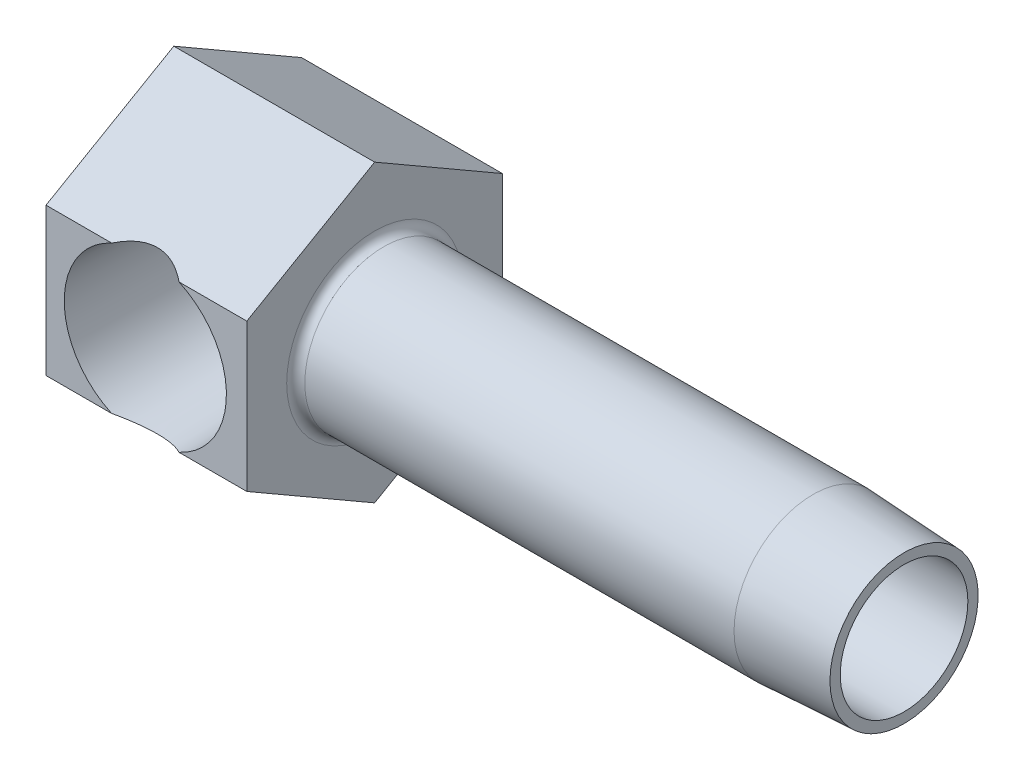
ISO-10303-21;
HEADER;
FILE_DESCRIPTION(('STEP AP214'),'2;1');
FILE_NAME('part.step','',(''),(''),'','','');
FILE_SCHEMA(('AUTOMOTIVE_DESIGN { 1 0 10303 214 1 1 1 1 }'));
ENDSEC;
DATA;
#1=APPLICATION_CONTEXT('core data for automotive mechanical design processes');
#2=APPLICATION_PROTOCOL_DEFINITION('international standard','automotive_design',2000,#1);
#3=PRODUCT_CONTEXT('',#1,'mechanical');
#4=PRODUCT('Part','Part','',(#3));
#5=PRODUCT_RELATED_PRODUCT_CATEGORY('part','',(#4));
#6=PRODUCT_DEFINITION_FORMATION('','',#4);
#7=PRODUCT_DEFINITION_CONTEXT('part definition',#1,'design');
#8=PRODUCT_DEFINITION('design','',#6,#7);
#9=PRODUCT_DEFINITION_SHAPE('','',#8);
#10=(LENGTH_UNIT() NAMED_UNIT(*) SI_UNIT(.MILLI.,.METRE.));
#11=(NAMED_UNIT(*) PLANE_ANGLE_UNIT() SI_UNIT($,.RADIAN.));
#12=(NAMED_UNIT(*) SI_UNIT($,.STERADIAN.) SOLID_ANGLE_UNIT());
#13=UNCERTAINTY_MEASURE_WITH_UNIT(LENGTH_MEASURE(1.E-05),#10,'distance_accuracy_value','');
#14=(GEOMETRIC_REPRESENTATION_CONTEXT(3) GLOBAL_UNCERTAINTY_ASSIGNED_CONTEXT((#13)) GLOBAL_UNIT_ASSIGNED_CONTEXT((#10,
#11,#12)) REPRESENTATION_CONTEXT('',''));
#15=CARTESIAN_POINT('',(0.,0.,0.));
#16=DIRECTION('',(0.,0.,1.));
#17=DIRECTION('',(1.,0.,0.));
#18=AXIS2_PLACEMENT_3D('',#15,#16,#17);
#19=CARTESIAN_POINT('',(17.4625,6.4158048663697,22.225));
#20=DIRECTION('',(0.,0.,-1.));
#21=DIRECTION('',(0.,1.,0.));
#22=AXIS2_PLACEMENT_3D('',#19,#20,#21);
#23=PLANE('',#22);
#24=CARTESIAN_POINT('',(8.636,0.,22.225));
#25=DIRECTION('',(0.,0.,1.));
#26=DIRECTION('',(1.,0.,0.));
#27=AXIS2_PLACEMENT_3D('',#24,#25,#26);
#28=CIRCLE('',#27,7.05231);
#29=CARTESIAN_POINT('',(5.70811266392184,6.4158048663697,22.225));
#30=VERTEX_POINT('',#29);
#31=CARTESIAN_POINT('',(5.70811266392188,-6.41580486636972,22.225));
#32=VERTEX_POINT('',#31);
#33=EDGE_CURVE('E264',#30,#32,#28,.T.);
#34=ORIENTED_EDGE('',*,*,#33,.F.);
#35=DIRECTION('',(-1.,0.,0.));
#36=VECTOR('',#35,1.);
#37=CARTESIAN_POINT('',(17.4625,6.4158048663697,22.225));
#38=LINE('',#37,#36);
#39=CARTESIAN_POINT('',(0.,6.4158048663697,22.225));
#40=VERTEX_POINT('',#39);
#41=EDGE_CURVE('E164',#30,#40,#38,.T.);
#42=ORIENTED_EDGE('',*,*,#41,.T.);
#43=DIRECTION('',(0.,-1.,0.));
#44=VECTOR('',#43,1.);
#45=CARTESIAN_POINT('',(0.,6.4158048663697,22.225));
#46=LINE('',#45,#44);
#47=CARTESIAN_POINT('',(0.,-6.41580486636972,22.225));
#48=VERTEX_POINT('',#47);
#49=EDGE_CURVE('E134',#40,#48,#46,.T.);
#50=ORIENTED_EDGE('',*,*,#49,.T.);
#51=DIRECTION('',(-1.,0.,0.));
#52=VECTOR('',#51,1.);
#53=CARTESIAN_POINT('',(17.4625,-6.41580486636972,22.225));
#54=LINE('',#53,#52);
#55=EDGE_CURVE('E160',#32,#48,#54,.T.);
#56=ORIENTED_EDGE('',*,*,#55,.F.);
#57=EDGE_LOOP('',(#34,#42,#50,#56));
#58=FACE_BOUND('',#57,.T.);
#59=ADVANCED_FACE('F15',(#58),#23,.F.);
#60=CARTESIAN_POINT('',(11.5638873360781,-6.41580486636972,22.225));
#61=VERTEX_POINT('',#60);
#62=CARTESIAN_POINT('',(11.5638873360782,6.4158048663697,22.225));
#63=VERTEX_POINT('',#62);
#64=EDGE_CURVE('E265',#61,#63,#28,.T.);
#65=ORIENTED_EDGE('',*,*,#64,.F.);
#66=CARTESIAN_POINT('',(17.4625,-6.41580486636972,22.225));
#67=VERTEX_POINT('',#66);
#68=EDGE_CURVE('E161',#67,#61,#54,.T.);
#69=ORIENTED_EDGE('',*,*,#68,.F.);
#70=DIRECTION('',(0.,-1.,0.));
#71=VECTOR('',#70,1.);
#72=CARTESIAN_POINT('',(17.4625,6.4158048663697,22.225));
#73=LINE('',#72,#71);
#74=CARTESIAN_POINT('',(17.4625,6.4158048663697,22.225));
#75=VERTEX_POINT('',#74);
#76=EDGE_CURVE('E151',#75,#67,#73,.T.);
#77=ORIENTED_EDGE('',*,*,#76,.F.);
#78=EDGE_CURVE('E165',#75,#63,#38,.T.);
#79=ORIENTED_EDGE('',*,*,#78,.T.);
#80=EDGE_LOOP('',(#65,#69,#77,#79));
#81=FACE_BOUND('',#80,.T.);
#82=ADVANCED_FACE('F212',(#81),#23,.F.);
#83=CARTESIAN_POINT('',(63.5,0.,11.1125));
#84=DIRECTION('',(-1.,0.,0.));
#85=DIRECTION('',(0.,0.,1.));
#86=AXIS2_PLACEMENT_3D('',#83,#84,#85);
#87=PLANE('',#86);
#88=CARTESIAN_POINT('',(63.5,0.,11.1125));
#89=DIRECTION('',(1.,0.,0.));
#90=DIRECTION('',(0.,0.,-1.));
#91=AXIS2_PLACEMENT_3D('',#88,#89,#90);
#92=CIRCLE('',#91,5.5499);
#93=CARTESIAN_POINT('',(63.5,0.,5.5626));
#94=VERTEX_POINT('',#93);
#95=EDGE_CURVE('E117',#94,#94,#92,.T.);
#96=ORIENTED_EDGE('',*,*,#95,.F.);
#97=EDGE_LOOP('',(#96));
#98=FACE_BOUND('',#97,.T.);
#99=CARTESIAN_POINT('',(63.5,0.,11.1125));
#100=DIRECTION('',(-1.,0.,0.));
#101=DIRECTION('',(0.,0.,1.));
#102=AXIS2_PLACEMENT_3D('',#99,#100,#101);
#103=CIRCLE('',#102,6.44267883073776);
#104=CARTESIAN_POINT('',(63.5,0.,17.5551788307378));
#105=VERTEX_POINT('',#104);
#106=EDGE_CURVE('E183',#105,#105,#103,.F.);
#107=ORIENTED_EDGE('',*,*,#106,.T.);
#108=EDGE_LOOP('',(#107));
#109=FACE_BOUND('',#108,.T.);
#110=ADVANCED_FACE('F219',(#98,#109),#87,.F.);
#111=CARTESIAN_POINT('',(17.4625,12.8316097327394,11.1125));
#112=DIRECTION('',(0.,-0.866025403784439,-0.5));
#113=DIRECTION('',(0.,0.5,-0.866025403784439));
#114=AXIS2_PLACEMENT_3D('',#111,#112,#113);
#115=PLANE('',#114);
#116=ORIENTED_EDGE('',*,*,#41,.F.);
#117=CARTESIAN_POINT('',(8.636,-0.384020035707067,34.002642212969));
#118=DIRECTION('',(0.,-0.866025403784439,-0.5));
#119=DIRECTION('',(0.,-0.5,0.866025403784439));
#120=AXIS2_PLACEMENT_3D('',#117,#118,#119);
#121=ELLIPSE('',#120,14.8098967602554,7.39498405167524);
#122=EDGE_CURVE('E109',#30,#63,#121,.T.);
#123=ORIENTED_EDGE('',*,*,#122,.T.);
#124=ORIENTED_EDGE('',*,*,#78,.F.);
#125=DIRECTION('',(0.,-0.5,0.866025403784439));
#126=VECTOR('',#125,1.);
#127=CARTESIAN_POINT('',(17.4625,12.8316097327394,11.1125));
#128=LINE('',#127,#126);
#129=CARTESIAN_POINT('',(17.4625,12.8316097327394,11.1125));
#130=VERTEX_POINT('',#129);
#131=EDGE_CURVE('E149',#130,#75,#128,.T.);
#132=ORIENTED_EDGE('',*,*,#131,.F.);
#133=DIRECTION('',(-1.,0.,0.));
#134=VECTOR('',#133,1.);
#135=CARTESIAN_POINT('',(17.4625,12.8316097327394,11.1125));
#136=LINE('',#135,#134);
#137=CARTESIAN_POINT('',(0.,12.8316097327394,11.1125));
#138=VERTEX_POINT('',#137);
#139=EDGE_CURVE('E168',#130,#138,#136,.T.);
#140=ORIENTED_EDGE('',*,*,#139,.T.);
#141=DIRECTION('',(0.,-0.5,0.866025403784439));
#142=VECTOR('',#141,1.);
#143=CARTESIAN_POINT('',(0.,12.8316097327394,11.1125));
#144=LINE('',#143,#142);
#145=EDGE_CURVE('E130',#138,#40,#144,.T.);
#146=ORIENTED_EDGE('',*,*,#145,.T.);
#147=EDGE_LOOP('',(#116,#123,#124,#132,#140,#146));
#148=FACE_BOUND('',#147,.T.);
#149=ADVANCED_FACE('F226',(#148),#115,.F.);
#150=CARTESIAN_POINT('',(17.4625,-6.41580486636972,22.225));
#151=DIRECTION('',(0.,0.866025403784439,-0.5));
#152=DIRECTION('',(0.,0.5,0.866025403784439));
#153=AXIS2_PLACEMENT_3D('',#150,#151,#152);
#154=PLANE('',#153);
#155=ORIENTED_EDGE('',*,*,#68,.T.);
#156=CARTESIAN_POINT('',(8.636,0.384020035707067,34.0026422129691));
#157=DIRECTION('',(0.,0.866025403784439,-0.5));
#158=DIRECTION('',(0.,0.5,0.866025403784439));
#159=AXIS2_PLACEMENT_3D('',#156,#157,#158);
#160=ELLIPSE('',#159,14.8098967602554,7.39498405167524);
#161=EDGE_CURVE('E35',#61,#32,#160,.T.);
#162=ORIENTED_EDGE('',*,*,#161,.T.);
#163=ORIENTED_EDGE('',*,*,#55,.T.);
#164=DIRECTION('',(0.,-0.5,-0.866025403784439));
#165=VECTOR('',#164,1.);
#166=CARTESIAN_POINT('',(0.,-6.41580486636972,22.225));
#167=LINE('',#166,#165);
#168=CARTESIAN_POINT('',(0.,-12.8316097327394,11.1125));
#169=VERTEX_POINT('',#168);
#170=EDGE_CURVE('E138',#48,#169,#167,.T.);
#171=ORIENTED_EDGE('',*,*,#170,.T.);
#172=DIRECTION('',(-1.,0.,0.));
#173=VECTOR('',#172,1.);
#174=CARTESIAN_POINT('',(17.4625,-12.8316097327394,11.1125));
#175=LINE('',#174,#173);
#176=CARTESIAN_POINT('',(17.4625,-12.8316097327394,11.1125));
#177=VERTEX_POINT('',#176);
#178=EDGE_CURVE('E155',#177,#169,#175,.T.);
#179=ORIENTED_EDGE('',*,*,#178,.F.);
#180=DIRECTION('',(0.,-0.5,-0.866025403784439));
#181=VECTOR('',#180,1.);
#182=CARTESIAN_POINT('',(17.4625,-6.41580486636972,22.225));
#183=LINE('',#182,#181);
#184=EDGE_CURVE('E153',#67,#177,#183,.T.);
#185=ORIENTED_EDGE('',*,*,#184,.F.);
#186=EDGE_LOOP('',(#155,#162,#163,#171,#179,#185));
#187=FACE_BOUND('',#186,.T.);
#188=ADVANCED_FACE('F224',(#187),#154,.F.);
#189=CARTESIAN_POINT('',(17.4625,-12.8316097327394,11.1125));
#190=DIRECTION('',(0.,0.866025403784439,0.5));
#191=DIRECTION('',(0.,-0.5,0.866025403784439));
#192=AXIS2_PLACEMENT_3D('',#189,#190,#191);
#193=PLANE('',#192);
#194=DIRECTION('',(0.,0.5,-0.866025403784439));
#195=VECTOR('',#194,1.);
#196=CARTESIAN_POINT('',(0.,-12.8316097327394,11.1125));
#197=LINE('',#196,#195);
#198=CARTESIAN_POINT('',(0.,-6.41580486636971,0.));
#199=VERTEX_POINT('',#198);
#200=EDGE_CURVE('E123',#169,#199,#197,.T.);
#201=ORIENTED_EDGE('',*,*,#200,.T.);
#202=DIRECTION('',(-1.,0.,0.));
#203=VECTOR('',#202,1.);
#204=CARTESIAN_POINT('',(17.4625,-6.41580486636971,0.));
#205=LINE('',#204,#203);
#206=CARTESIAN_POINT('',(17.4625,-6.41580486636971,0.));
#207=VERTEX_POINT('',#206);
#208=EDGE_CURVE('E174',#207,#199,#205,.T.);
#209=ORIENTED_EDGE('',*,*,#208,.F.);
#210=DIRECTION('',(0.,0.5,-0.866025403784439));
#211=VECTOR('',#210,1.);
#212=CARTESIAN_POINT('',(17.4625,-12.8316097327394,11.1125));
#213=LINE('',#212,#211);
#214=EDGE_CURVE('E141',#177,#207,#213,.T.);
#215=ORIENTED_EDGE('',*,*,#214,.F.);
#216=ORIENTED_EDGE('',*,*,#178,.T.);
#217=EDGE_LOOP('',(#201,#209,#215,#216));
#218=FACE_BOUND('',#217,.T.);
#219=ADVANCED_FACE('F17',(#218),#193,.F.);
#220=CARTESIAN_POINT('',(17.4625,-6.41580486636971,0.));
#221=DIRECTION('',(0.,0.,1.));
#222=DIRECTION('',(1.,0.,0.));
#223=AXIS2_PLACEMENT_3D('',#220,#221,#222);
#224=PLANE('',#223);
#225=DIRECTION('',(0.,1.,0.));
#226=VECTOR('',#225,1.);
#227=CARTESIAN_POINT('',(0.,-6.41580486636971,0.));
#228=LINE('',#227,#226);
#229=CARTESIAN_POINT('',(0.,6.41580486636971,0.));
#230=VERTEX_POINT('',#229);
#231=EDGE_CURVE('E124',#199,#230,#228,.T.);
#232=ORIENTED_EDGE('',*,*,#231,.T.);
#233=DIRECTION('',(-1.,0.,0.));
#234=VECTOR('',#233,1.);
#235=CARTESIAN_POINT('',(17.4625,6.41580486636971,0.));
#236=LINE('',#235,#234);
#237=CARTESIAN_POINT('',(17.4625,6.41580486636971,0.));
#238=VERTEX_POINT('',#237);
#239=EDGE_CURVE('E171',#238,#230,#236,.T.);
#240=ORIENTED_EDGE('',*,*,#239,.F.);
#241=DIRECTION('',(0.,1.,0.));
#242=VECTOR('',#241,1.);
#243=CARTESIAN_POINT('',(17.4625,-6.41580486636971,0.));
#244=LINE('',#243,#242);
#245=EDGE_CURVE('E145',#207,#238,#244,.T.);
#246=ORIENTED_EDGE('',*,*,#245,.F.);
#247=ORIENTED_EDGE('',*,*,#208,.T.);
#248=EDGE_LOOP('',(#232,#240,#246,#247));
#249=FACE_BOUND('',#248,.T.);
#250=ADVANCED_FACE('F233',(#249),#224,.F.);
#251=CARTESIAN_POINT('',(17.4625,6.4158048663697,0.));
#252=DIRECTION('',(0.,-0.866025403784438,0.5));
#253=DIRECTION('',(0.,-0.5,-0.866025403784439));
#254=AXIS2_PLACEMENT_3D('',#251,#252,#253);
#255=PLANE('',#254);
#256=DIRECTION('',(0.,0.5,0.866025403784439));
#257=VECTOR('',#256,1.);
#258=CARTESIAN_POINT('',(0.,6.4158048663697,0.));
#259=LINE('',#258,#257);
#260=EDGE_CURVE('E127',#230,#138,#259,.T.);
#261=ORIENTED_EDGE('',*,*,#260,.T.);
#262=ORIENTED_EDGE('',*,*,#139,.F.);
#263=DIRECTION('',(0.,0.5,0.866025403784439));
#264=VECTOR('',#263,1.);
#265=CARTESIAN_POINT('',(17.4625,6.4158048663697,0.));
#266=LINE('',#265,#264);
#267=EDGE_CURVE('E147',#238,#130,#266,.T.);
#268=ORIENTED_EDGE('',*,*,#267,.F.);
#269=ORIENTED_EDGE('',*,*,#239,.T.);
#270=EDGE_LOOP('',(#261,#262,#268,#269));
#271=FACE_BOUND('',#270,.T.);
#272=ADVANCED_FACE('F230',(#271),#255,.F.);
#273=CARTESIAN_POINT('',(17.4625,-19.2474145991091,22.225));
#274=DIRECTION('',(-1.,0.,0.));
#275=DIRECTION('',(0.,-1.,0.));
#276=AXIS2_PLACEMENT_3D('',#273,#274,#275);
#277=PLANE('',#276);
#278=CARTESIAN_POINT('',(17.4625,0.,11.1125));
#279=DIRECTION('',(-1.,0.,0.));
#280=DIRECTION('',(0.,-1.,0.));
#281=AXIS2_PLACEMENT_3D('',#278,#279,#280);
#282=CIRCLE('',#281,7.6454);
#283=CARTESIAN_POINT('',(17.4625,-7.6454,11.1125));
#284=VERTEX_POINT('',#283);
#285=EDGE_CURVE('E177',#284,#284,#282,.T.);
#286=ORIENTED_EDGE('',*,*,#285,.T.);
#287=EDGE_LOOP('',(#286));
#288=FACE_BOUND('',#287,.T.);
#289=ORIENTED_EDGE('',*,*,#214,.T.);
#290=ORIENTED_EDGE('',*,*,#245,.T.);
#291=ORIENTED_EDGE('',*,*,#267,.T.);
#292=ORIENTED_EDGE('',*,*,#131,.T.);
#293=ORIENTED_EDGE('',*,*,#76,.T.);
#294=ORIENTED_EDGE('',*,*,#184,.T.);
#295=EDGE_LOOP('',(#289,#290,#291,#292,#293,#294));
#296=FACE_BOUND('',#295,.T.);
#297=ADVANCED_FACE('F232',(#288,#296),#277,.F.);
#298=CARTESIAN_POINT('',(0.,-19.2474145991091,22.225));
#299=DIRECTION('',(-1.,0.,0.));
#300=DIRECTION('',(0.,-1.,0.));
#301=AXIS2_PLACEMENT_3D('',#298,#299,#300);
#302=PLANE('',#301);
#303=ORIENTED_EDGE('',*,*,#200,.F.);
#304=ORIENTED_EDGE('',*,*,#170,.F.);
#305=ORIENTED_EDGE('',*,*,#49,.F.);
#306=ORIENTED_EDGE('',*,*,#145,.F.);
#307=ORIENTED_EDGE('',*,*,#260,.F.);
#308=ORIENTED_EDGE('',*,*,#231,.F.);
#309=EDGE_LOOP('',(#303,#304,#305,#306,#307,#308));
#310=FACE_BOUND('',#309,.T.);
#311=ADVANCED_FACE('F250',(#310),#302,.T.);
#312=CARTESIAN_POINT('',(63.5,0.,11.1125));
#313=DIRECTION('',(-1.,0.,0.));
#314=DIRECTION('',(0.,0.,1.));
#315=AXIS2_PLACEMENT_3D('',#312,#313,#314);
#316=CYLINDRICAL_SURFACE('',#315,6.858);
#317=CARTESIAN_POINT('',(55.5752,0.,11.1125));
#318=DIRECTION('',(-1.,0.,0.));
#319=DIRECTION('',(0.,0.,1.));
#320=AXIS2_PLACEMENT_3D('',#317,#318,#319);
#321=CIRCLE('',#320,6.858);
#322=CARTESIAN_POINT('',(55.5752,0.,17.9705));
#323=VERTEX_POINT('',#322);
#324=EDGE_CURVE('E120',#323,#323,#321,.F.);
#325=ORIENTED_EDGE('',*,*,#324,.F.);
#326=EDGE_LOOP('',(#325));
#327=FACE_BOUND('',#326,.T.);
#328=CARTESIAN_POINT('',(18.2499,0.,11.1125));
#329=DIRECTION('',(-1.,0.,0.));
#330=DIRECTION('',(0.,-1.,0.));
#331=AXIS2_PLACEMENT_3D('',#328,#329,#330);
#332=CIRCLE('',#331,6.858);
#333=CARTESIAN_POINT('',(18.2499,-6.858,11.1125));
#334=VERTEX_POINT('',#333);
#335=EDGE_CURVE('E180',#334,#334,#332,.F.);
#336=ORIENTED_EDGE('',*,*,#335,.T.);
#337=EDGE_LOOP('',(#336));
#338=FACE_BOUND('',#337,.T.);
#339=ADVANCED_FACE('F288',(#327,#338),#316,.T.);
#340=CARTESIAN_POINT('',(18.2499,0.,11.1125));
#341=DIRECTION('',(-1.,0.,0.));
#342=DIRECTION('',(0.,-1.,0.));
#343=AXIS2_PLACEMENT_3D('',#340,#341,#342);
#344=TOROIDAL_SURFACE('',#343,7.6454,0.7874);
#345=ORIENTED_EDGE('',*,*,#335,.F.);
#346=EDGE_LOOP('',(#345));
#347=FACE_BOUND('',#346,.T.);
#348=ORIENTED_EDGE('',*,*,#285,.F.);
#349=EDGE_LOOP('',(#348));
#350=FACE_BOUND('',#349,.T.);
#351=ADVANCED_FACE('F282',(#347,#350),#344,.F.);
#352=CARTESIAN_POINT('',(63.5029494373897,0.,11.1125));
#353=DIRECTION('',(-1.,0.,0.));
#354=DIRECTION('',(0.,0.,1.));
#355=AXIS2_PLACEMENT_3D('',#352,#353,#354);
#356=CONICAL_SURFACE('',#355,6.44252425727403,0.0523598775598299);
#357=ORIENTED_EDGE('',*,*,#324,.T.);
#358=EDGE_LOOP('',(#357));
#359=FACE_BOUND('',#358,.T.);
#360=ORIENTED_EDGE('',*,*,#106,.F.);
#361=EDGE_LOOP('',(#360));
#362=FACE_BOUND('',#361,.T.);
#363=ADVANCED_FACE('F273',(#359,#362),#356,.T.);
#364=CARTESIAN_POINT('',(63.5,0.,11.1125));
#365=DIRECTION('',(1.,0.,0.));
#366=DIRECTION('',(0.,0.,-1.));
#367=AXIS2_PLACEMENT_3D('',#364,#365,#366);
#368=CYLINDRICAL_SURFACE('',#367,5.5499);
#369=DIRECTION('',(1.,0.,0.));
#370=VECTOR('',#369,1.);
#371=CARTESIAN_POINT('',(63.5,1.29165930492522,5.715));
#372=LINE('',#371,#370);
#373=CARTESIAN_POINT('',(15.0655177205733,1.29165930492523,5.715));
#374=VERTEX_POINT('',#373);
#375=CARTESIAN_POINT('',(14.0465577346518,1.29165930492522,5.715));
#376=VERTEX_POINT('',#375);
#377=EDGE_CURVE('E28',#374,#376,#372,.F.);
#378=ORIENTED_EDGE('',*,*,#377,.T.);
#379=CARTESIAN_POINT('',(14.0465577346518,1.29165930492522,5.715));
#380=CARTESIAN_POINT('',(14.0725617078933,1.1828202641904,5.68893317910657));
#381=CARTESIAN_POINT('',(14.0954190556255,1.0724477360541,5.66602138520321));
#382=CARTESIAN_POINT('',(14.1345363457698,0.849345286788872,5.62681178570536));
#383=CARTESIAN_POINT('',(14.1507939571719,0.736614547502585,5.61051631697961));
#384=CARTESIAN_POINT('',(14.1760383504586,0.512691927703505,5.58521342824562));
#385=CARTESIAN_POINT('',(14.1852120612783,0.401542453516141,5.57601863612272));
#386=CARTESIAN_POINT('',(14.1968530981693,0.17856718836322,5.56435088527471));
#387=CARTESIAN_POINT('',(14.1993222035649,0.0667415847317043,5.56187614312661));
#388=CARTESIAN_POINT('',(14.1975723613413,-0.14949882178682,5.56362999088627));
#389=CARTESIAN_POINT('',(14.193779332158,-0.253921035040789,5.56743168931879));
#390=CARTESIAN_POINT('',(14.1803598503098,-0.462026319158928,5.58088200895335));
#391=CARTESIAN_POINT('',(14.1707325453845,-0.565709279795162,5.59053148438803));
#392=CARTESIAN_POINT('',(14.1454600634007,-0.774399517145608,5.61586264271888));
#393=CARTESIAN_POINT('',(14.12966315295,-0.87936981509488,5.63169642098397));
#394=CARTESIAN_POINT('',(14.092340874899,-1.08722287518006,5.6691068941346));
#395=CARTESIAN_POINT('',(14.0708169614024,-1.1901061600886,5.69068213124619));
#396=CARTESIAN_POINT('',(14.0465577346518,-1.29165930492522,5.715));
#397=B_SPLINE_CURVE_WITH_KNOTS('',3,(#379,#380,#381,#382,#383,#384,#385,#386,#387,#388,#389,
#390,#391,#392,#393,#394,#395,#396),.UNSPECIFIED.,.F.,.F.,(4,2,2,2,2,2,2,2,4),(0.,
0.344637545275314,0.689396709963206,1.02471413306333,1.35994255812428,1.67329546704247,
1.98669416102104,2.30834220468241,2.62990865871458),.UNSPECIFIED.);
#398=CARTESIAN_POINT('',(14.0465577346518,-1.29165930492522,5.715));
#399=VERTEX_POINT('',#398);
#400=EDGE_CURVE('E10',#376,#399,#397,.T.);
#401=ORIENTED_EDGE('',*,*,#400,.T.);
#402=DIRECTION('',(1.,0.,0.));
#403=VECTOR('',#402,1.);
#404=CARTESIAN_POINT('',(63.5,-1.29165930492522,5.715));
#405=LINE('',#404,#403);
#406=CARTESIAN_POINT('',(15.0655177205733,-1.29165930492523,5.715));
#407=VERTEX_POINT('',#406);
#408=EDGE_CURVE('E193',#399,#407,#405,.T.);
#409=ORIENTED_EDGE('',*,*,#408,.T.);
#410=CARTESIAN_POINT('',(15.0656795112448,-1.29082327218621,5.71480000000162));
#411=CARTESIAN_POINT('',(15.0372536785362,-1.43791824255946,5.7499521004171));
#412=CARTESIAN_POINT('',(15.0041876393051,-1.58262926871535,5.79093746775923));
#413=CARTESIAN_POINT('',(14.9298152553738,-1.86616189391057,5.88364074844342));
#414=CARTESIAN_POINT('',(14.8885204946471,-2.00499144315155,5.93534357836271));
#415=CARTESIAN_POINT('',(14.7990709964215,-2.27477346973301,6.0481148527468));
#416=CARTESIAN_POINT('',(14.7509848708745,-2.40578805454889,6.10909004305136));
#417=CARTESIAN_POINT('',(14.6486806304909,-2.66083130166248,6.2399326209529));
#418=CARTESIAN_POINT('',(14.5944604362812,-2.78485757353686,6.30980302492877));
#419=CARTESIAN_POINT('',(14.4812536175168,-3.02482355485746,6.4572285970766));
#420=CARTESIAN_POINT('',(14.4222960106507,-3.1408054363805,6.53473755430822));
#421=CARTESIAN_POINT('',(14.3003856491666,-3.365215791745,6.6970845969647));
#422=CARTESIAN_POINT('',(14.2374332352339,-3.47364490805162,6.78192205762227));
#423=CARTESIAN_POINT('',(14.0435453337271,-3.78827180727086,7.04729631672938));
#424=CARTESIAN_POINT('',(13.9079456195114,-3.9830565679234,7.23822682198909));
#425=CARTESIAN_POINT('',(13.689310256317,-4.26816238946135,7.56146618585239));
#426=CARTESIAN_POINT('',(13.6074310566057,-4.3686517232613,7.68585924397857));
#427=CARTESIAN_POINT('',(13.4442899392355,-4.55879004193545,7.94320688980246));
#428=CARTESIAN_POINT('',(13.3630282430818,-4.6484352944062,8.07616440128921));
#429=CARTESIAN_POINT('',(13.2036424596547,-4.81645966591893,8.35044586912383));
#430=CARTESIAN_POINT('',(13.1255135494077,-4.89485662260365,8.49175606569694));
#431=CARTESIAN_POINT('',(12.9752684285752,-5.04004510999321,8.78316437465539));
#432=CARTESIAN_POINT('',(12.9031480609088,-5.10684469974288,8.93325628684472));
#433=CARTESIAN_POINT('',(12.757824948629,-5.23785122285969,9.26762207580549));
#434=CARTESIAN_POINT('',(12.686320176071,-5.29990617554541,9.45350692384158));
#435=CARTESIAN_POINT('',(12.5645322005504,-5.40502712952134,9.83721903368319));
#436=CARTESIAN_POINT('',(12.5142004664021,-5.44813656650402,10.035017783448));
#437=CARTESIAN_POINT('',(12.4606756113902,-5.49679755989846,10.3395644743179));
#438=CARTESIAN_POINT('',(12.4464754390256,-5.51038902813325,10.443158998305));
#439=CARTESIAN_POINT('',(12.4264834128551,-5.5317354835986,10.6517762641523));
#440=CARTESIAN_POINT('',(12.4206908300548,-5.53949097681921,10.7567988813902));
#441=CARTESIAN_POINT('',(12.4179376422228,-5.54899639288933,10.9671942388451));
#442=CARTESIAN_POINT('',(12.4209736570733,-5.55074861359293,11.0725668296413));
#443=CARTESIAN_POINT('',(12.4357182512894,-5.54828805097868,11.2826067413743));
#444=CARTESIAN_POINT('',(12.4474268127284,-5.54407527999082,11.3872740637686));
#445=CARTESIAN_POINT('',(12.4900727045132,-5.52483789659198,11.6684350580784));
#446=CARTESIAN_POINT('',(12.5287513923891,-5.5042766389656,11.8434168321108));
#447=CARTESIAN_POINT('',(12.6245766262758,-5.44793106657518,12.1856637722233));
#448=CARTESIAN_POINT('',(12.6817493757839,-5.41212512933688,12.3529176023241));
#449=CARTESIAN_POINT('',(12.8020710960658,-5.33165221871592,12.6608364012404));
#450=CARTESIAN_POINT('',(12.8638814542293,-5.28838367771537,12.8024081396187));
#451=CARTESIAN_POINT('',(12.9946271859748,-5.19196308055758,13.0788046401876));
#452=CARTESIAN_POINT('',(13.0635675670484,-5.13880405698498,13.2136245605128));
#453=CARTESIAN_POINT('',(13.2061680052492,-5.0230773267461,13.476991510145));
#454=CARTESIAN_POINT('',(13.2798387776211,-4.96048779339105,13.6055230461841));
#455=CARTESIAN_POINT('',(13.4297455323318,-4.82635797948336,13.8561944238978));
#456=CARTESIAN_POINT('',(13.505980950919,-4.75481965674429,13.9783356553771));
#457=CARTESIAN_POINT('',(13.664111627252,-4.59832635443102,14.2236446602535));
#458=CARTESIAN_POINT('',(13.7460684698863,-4.51281916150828,14.3464205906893));
#459=CARTESIAN_POINT('',(13.9094765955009,-4.33199713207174,14.5849036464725));
#460=CARTESIAN_POINT('',(13.9909278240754,-4.23668125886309,14.7006100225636));
#461=CARTESIAN_POINT('',(14.1517819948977,-4.03638256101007,14.9245234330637));
#462=CARTESIAN_POINT('',(14.231187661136,-3.93141354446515,15.0327408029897));
#463=CARTESIAN_POINT('',(14.3867175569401,-3.71172769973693,15.2413555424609));
#464=CARTESIAN_POINT('',(14.4628409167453,-3.59700831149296,15.3417508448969));
#465=CARTESIAN_POINT('',(14.668135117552,-3.26437402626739,15.6091426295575));
#466=CARTESIAN_POINT('',(14.7924014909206,-3.03572507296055,15.7670513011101));
#467=CARTESIAN_POINT('',(14.961823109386,-2.67104021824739,15.9794040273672));
#468=CARTESIAN_POINT('',(15.0154673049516,-2.54586009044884,16.0461031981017));
#469=CARTESIAN_POINT('',(15.1161712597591,-2.28856209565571,16.1705894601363));
#470=CARTESIAN_POINT('',(15.1632322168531,-2.15644549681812,16.2283781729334));
#471=CARTESIAN_POINT('',(15.2428146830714,-1.9076542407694,16.3256678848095));
#472=CARTESIAN_POINT('',(15.2764575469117,-1.79190088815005,16.3666154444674));
#473=CARTESIAN_POINT('',(15.3378292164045,-1.55651069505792,16.4410921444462));
#474=CARTESIAN_POINT('',(15.3655591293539,-1.43687458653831,16.4746226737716));
#475=CARTESIAN_POINT('',(15.4145953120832,-1.19439983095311,16.5337884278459));
#476=CARTESIAN_POINT('',(15.4359031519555,-1.0715619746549,16.5594255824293));
#477=CARTESIAN_POINT('',(15.4716760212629,-0.823504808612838,16.6024058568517));
#478=CARTESIAN_POINT('',(15.4861437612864,-0.698286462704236,16.6197522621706));
#479=CARTESIAN_POINT('',(15.5079865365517,-0.445852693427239,16.645922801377));
#480=CARTESIAN_POINT('',(15.5153340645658,-0.318631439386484,16.6547138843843));
#481=CARTESIAN_POINT('',(15.522677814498,-0.063671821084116,16.6635004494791));
#482=CARTESIAN_POINT('',(15.5226740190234,0.0640665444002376,16.6634959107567));
#483=CARTESIAN_POINT('',(15.5153149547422,0.319031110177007,16.6546910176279));
#484=CARTESIAN_POINT('',(15.5079593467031,0.446257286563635,16.64589025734));
#485=CARTESIAN_POINT('',(15.4860583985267,0.699182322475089,16.6196499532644));
#486=CARTESIAN_POINT('',(15.4715132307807,0.824881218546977,16.6022106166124));
#487=CARTESIAN_POINT('',(15.4365532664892,1.06681669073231,16.5602063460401));
#488=CARTESIAN_POINT('',(15.4165150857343,1.18318753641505,16.5360979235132));
#489=CARTESIAN_POINT('',(15.370668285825,1.41308832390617,16.4807930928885));
#490=CARTESIAN_POINT('',(15.3448577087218,1.52661728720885,16.4495942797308));
#491=CARTESIAN_POINT('',(15.2593968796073,1.8619852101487,16.3459550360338));
#492=CARTESIAN_POINT('',(15.1916934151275,2.07876635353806,16.2634431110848));
#493=CARTESIAN_POINT('',(15.0313088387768,2.51543897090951,16.0659794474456));
#494=CARTESIAN_POINT('',(14.9368359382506,2.73357267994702,15.9486491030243));
#495=CARTESIAN_POINT('',(14.7321201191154,3.14711164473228,15.6903358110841));
#496=CARTESIAN_POINT('',(14.6218705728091,3.34250728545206,15.549342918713));
#497=CARTESIAN_POINT('',(14.3660176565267,3.74896640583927,15.2149275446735));
#498=CARTESIAN_POINT('',(14.217881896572,3.95452519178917,15.0167316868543));
#499=CARTESIAN_POINT('',(13.9905991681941,4.23685264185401,14.7000501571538));
#500=CARTESIAN_POINT('',(13.9138995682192,4.32671599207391,14.5911203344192));
#501=CARTESIAN_POINT('',(13.7600052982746,4.49774000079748,14.366972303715));
#502=CARTESIAN_POINT('',(13.682810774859,4.57890311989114,14.2517558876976));
#503=CARTESIAN_POINT('',(13.5283146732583,4.73340315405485,14.0136509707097));
#504=CARTESIAN_POINT('',(13.4510233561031,4.80663208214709,13.8906858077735));
#505=CARTESIAN_POINT('',(13.2989020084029,4.94395744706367,13.6382338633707));
#506=CARTESIAN_POINT('',(13.2240725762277,5.00805167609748,13.5087455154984));
#507=CARTESIAN_POINT('',(13.0790371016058,5.12664196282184,13.2432341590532));
#508=CARTESIAN_POINT('',(13.0088235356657,5.18115389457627,13.107222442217));
#509=CARTESIAN_POINT('',(12.8755190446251,5.28008101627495,12.8283198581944));
#510=CARTESIAN_POINT('',(12.8124234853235,5.3245027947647,12.6854335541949));
#511=CARTESIAN_POINT('',(12.6833891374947,5.4112685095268,12.3591277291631));
#512=CARTESIAN_POINT('',(12.6200540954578,5.45085356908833,12.1738679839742));
#513=CARTESIAN_POINT('',(12.5423523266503,5.49611259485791,11.8892630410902));
#514=CARTESIAN_POINT('',(12.5193453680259,5.50884182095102,11.7933456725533));
#515=CARTESIAN_POINT('',(12.4799604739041,5.52933440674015,11.5996550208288));
#516=CARTESIAN_POINT('',(12.4635791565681,5.53710030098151,11.5018827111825));
#517=CARTESIAN_POINT('',(12.4380468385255,5.54748556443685,11.3040796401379));
#518=CARTESIAN_POINT('',(12.4289726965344,5.55005064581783,11.2040359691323));
#519=CARTESIAN_POINT('',(12.418786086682,5.54973569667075,11.0035516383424));
#520=CARTESIAN_POINT('',(12.4176731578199,5.54685598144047,10.9031110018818));
#521=CARTESIAN_POINT('',(12.4234254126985,5.53566138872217,10.7027211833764));
#522=CARTESIAN_POINT('',(12.4302942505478,5.52734402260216,10.6027722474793));
#523=CARTESIAN_POINT('',(12.4515981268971,5.5054275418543,10.4042328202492));
#524=CARTESIAN_POINT('',(12.4660373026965,5.4918255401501,10.3056431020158));
#525=CARTESIAN_POINT('',(12.5044721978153,5.45712893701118,10.0955734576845));
#526=CARTESIAN_POINT('',(12.5295946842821,5.43520467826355,9.98443807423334));
#527=CARTESIAN_POINT('',(12.5874763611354,5.38514310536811,9.76556012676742));
#528=CARTESIAN_POINT('',(12.6202414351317,5.35700100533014,9.65782024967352));
#529=CARTESIAN_POINT('',(12.6919869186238,5.29489520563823,9.44585515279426));
#530=CARTESIAN_POINT('',(12.7309829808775,5.2609168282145,9.34163960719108));
#531=CARTESIAN_POINT('',(12.813732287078,5.18758941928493,9.13712531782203));
#532=CARTESIAN_POINT('',(12.8574843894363,5.14824167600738,9.03682564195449));
#533=CARTESIAN_POINT('',(12.9739768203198,5.04107082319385,8.78510193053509));
#534=CARTESIAN_POINT('',(13.0492646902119,4.96961386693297,8.63639571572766));
#535=CARTESIAN_POINT('',(13.2048344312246,4.81508369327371,8.34787401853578));
#536=CARTESIAN_POINT('',(13.2851189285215,4.73200433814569,8.20806329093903));
#537=CARTESIAN_POINT('',(13.4480056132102,4.55446924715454,7.93688996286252));
#538=CARTESIAN_POINT('',(13.5306114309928,4.45999483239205,7.80554179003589));
#539=CARTESIAN_POINT('',(13.6957298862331,4.25996324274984,7.55156980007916));
#540=CARTESIAN_POINT('',(13.7782425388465,4.15440825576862,7.42894426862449));
#541=CARTESIAN_POINT('',(13.9441031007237,3.92836612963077,7.18853642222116));
#542=CARTESIAN_POINT('',(14.0273794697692,3.80748613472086,7.0710730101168));
#543=CARTESIAN_POINT('',(14.1898135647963,3.55392137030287,6.84638586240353));
#544=CARTESIAN_POINT('',(14.2689704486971,3.42123420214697,6.73916421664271));
#545=CARTESIAN_POINT('',(14.420885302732,3.14485348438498,6.53641941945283));
#546=CARTESIAN_POINT('',(14.4936705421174,3.0012123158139,6.44084565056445));
#547=CARTESIAN_POINT('',(14.6312840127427,2.70291662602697,6.2621549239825));
#548=CARTESIAN_POINT('',(14.6961173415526,2.54826926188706,6.17902997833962));
#549=CARTESIAN_POINT('',(14.8204425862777,2.21665612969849,6.02094073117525));
#550=CARTESIAN_POINT('',(14.8791782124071,2.03888590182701,5.94704372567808));
#551=CARTESIAN_POINT('',(14.957111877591,1.76426185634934,5.84958505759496));
#552=CARTESIAN_POINT('',(14.9814347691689,1.67119024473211,5.81928093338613));
#553=CARTESIAN_POINT('',(15.0263924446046,1.48269404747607,5.76341790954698));
#554=CARTESIAN_POINT('',(15.047024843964,1.38726798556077,5.73786207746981));
#555=CARTESIAN_POINT('',(15.0656795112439,1.2908232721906,5.71480000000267));
#556=B_SPLINE_CURVE_WITH_KNOTS('',3,(#410,#411,#412,#413,#414,#415,#416,#417,#418,#419,#420,
#421,#422,#423,#424,#425,#426,#427,#428,#429,#430,#431,#432,#433,#434,#435,#436,#437,#438,#439,
#440,#441,#442,#443,#444,#445,#446,#447,#448,#449,#450,#451,#452,#453,#454,#455,#456,#457,#458,
#459,#460,#461,#462,#463,#464,#465,#466,#467,#468,#469,#470,#471,#472,#473,#474,#475,#476,#477,
#478,#479,#480,#481,#482,#483,#484,#485,#486,#487,#488,#489,#490,#491,#492,#493,#494,#495,#496,
#497,#498,#499,#500,#501,#502,#503,#504,#505,#506,#507,#508,#509,#510,#511,#512,#513,#514,#515,
#516,#517,#518,#519,#520,#521,#522,#523,#524,#525,#526,#527,#528,#529,#530,#531,#532,#533,#534,
#535,#536,#537,#538,#539,#540,#541,#542,#543,#544,#545,#546,#547,#548,#549,#550,#551,#552,#553,
#554,#555),.UNSPECIFIED.,.F.,.F.,(4,2,2,2,2,2,2,2,2,2,2,2,2,2,2,2,2,2,2,2,2,2,2,2,2,2,2,2,2,2,2,
2,2,2,2,2,2,2,2,2,2,2,2,2,2,2,2,2,2,2,2,2,2,2,2,2,2,2,2,2,2,2,2,2,2,2,2,2,2,2,2,2,4),(0.,
0.461329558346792,0.922014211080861,1.37833951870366,1.83481998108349,2.2886910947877,
2.74252355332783,3.65304009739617,4.19159436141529,4.73033346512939,5.26820855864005,
5.80570837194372,6.42981366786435,7.05248053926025,7.36837231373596,7.68423669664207,
7.99998016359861,8.31572297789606,8.85459341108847,9.39423071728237,9.87481564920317,
10.3557404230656,10.837795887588,11.3197460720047,11.8310943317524,12.3424966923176,
12.8531785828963,13.3639949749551,14.2729996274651,14.7275015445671,15.1819206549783,
15.5634665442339,15.9449409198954,16.3263219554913,16.707551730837,17.0902484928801,
17.472946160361,17.8556614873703,18.2383676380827,18.5995247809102,18.9608046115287,
19.682873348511,20.4753483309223,21.2681572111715,22.2295647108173,22.7113905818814,
23.1930798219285,23.6806666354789,24.1683710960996,24.6552598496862,25.1418297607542,
25.7388115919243,26.0368814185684,26.3347989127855,26.6358104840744,26.9368046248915,
27.237936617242,27.5392333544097,27.8867825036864,28.2346001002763,28.5833055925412,
28.9319275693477,29.4751694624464,30.0186993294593,30.5631325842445,31.1074585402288,
31.6708023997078,32.2342609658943,32.7951763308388,33.3557302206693,33.9579898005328,
34.2603814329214,34.5629677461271),.UNSPECIFIED.);
#557=EDGE_CURVE('E186',#407,#374,#556,.T.);
#558=ORIENTED_EDGE('',*,*,#557,.T.);
#559=EDGE_LOOP('',(#378,#401,#409,#558));
#560=FACE_BOUND('',#559,.T.);
#561=ORIENTED_EDGE('',*,*,#95,.T.);
#562=EDGE_LOOP('',(#561));
#563=FACE_BOUND('',#562,.T.);
#564=ADVANCED_FACE('F194',(#560,#563),#368,.F.);
#565=CARTESIAN_POINT('',(14.1986,0.,5.715));
#566=DIRECTION('',(0.,0.,-1.));
#567=DIRECTION('',(-1.,0.,0.));
#568=AXIS2_PLACEMENT_3D('',#565,#566,#567);
#569=PLANE('',#568);
#570=CARTESIAN_POINT('',(8.636,0.,5.715));
#571=DIRECTION('',(0.,0.,1.));
#572=DIRECTION('',(1.,0.,0.));
#573=AXIS2_PLACEMENT_3D('',#570,#571,#572);
#574=CIRCLE('',#573,6.55797849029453);
#575=EDGE_CURVE('E42',#374,#407,#574,.T.);
#576=ORIENTED_EDGE('',*,*,#575,.T.);
#577=ORIENTED_EDGE('',*,*,#408,.F.);
#578=CARTESIAN_POINT('',(8.636,0.,5.715));
#579=DIRECTION('',(0.,0.,1.));
#580=DIRECTION('',(1.,0.,0.));
#581=AXIS2_PLACEMENT_3D('',#578,#579,#580);
#582=CIRCLE('',#581,5.5626);
#583=EDGE_CURVE('E107',#376,#399,#582,.T.);
#584=ORIENTED_EDGE('',*,*,#583,.F.);
#585=ORIENTED_EDGE('',*,*,#377,.F.);
#586=EDGE_LOOP('',(#576,#577,#584,#585));
#587=FACE_BOUND('',#586,.T.);
#588=ADVANCED_FACE('F201',(#587),#569,.F.);
#589=CARTESIAN_POINT('',(8.636,0.,22.225));
#590=DIRECTION('',(0.,0.,1.));
#591=DIRECTION('',(1.,0.,0.));
#592=AXIS2_PLACEMENT_3D('',#589,#590,#591);
#593=CYLINDRICAL_SURFACE('',#592,5.5626);
#594=CARTESIAN_POINT('',(8.636,0.,4.445));
#595=DIRECTION('',(0.,0.,1.));
#596=DIRECTION('',(1.,0.,0.));
#597=AXIS2_PLACEMENT_3D('',#594,#595,#596);
#598=CIRCLE('',#597,5.5626);
#599=CARTESIAN_POINT('',(14.1986,0.,4.445));
#600=VERTEX_POINT('',#599);
#601=EDGE_CURVE('E105',#600,#600,#598,.T.);
#602=ORIENTED_EDGE('',*,*,#601,.F.);
#603=EDGE_LOOP('',(#602));
#604=FACE_BOUND('',#603,.T.);
#605=ORIENTED_EDGE('',*,*,#583,.T.);
#606=ORIENTED_EDGE('',*,*,#400,.F.);
#607=EDGE_LOOP('',(#605,#606));
#608=FACE_BOUND('',#607,.T.);
#609=ADVANCED_FACE('F200',(#604,#608),#593,.F.);
#610=CARTESIAN_POINT('',(8.636,0.,22.225));
#611=DIRECTION('',(0.,0.,1.));
#612=DIRECTION('',(1.,0.,0.));
#613=AXIS2_PLACEMENT_3D('',#610,#611,#612);
#614=CONICAL_SURFACE('',#613,7.05231,0.0299323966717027);
#615=ORIENTED_EDGE('',*,*,#575,.F.);
#616=ORIENTED_EDGE('',*,*,#557,.F.);
#617=EDGE_LOOP('',(#615,#616));
#618=FACE_BOUND('',#617,.T.);
#619=ORIENTED_EDGE('',*,*,#33,.T.);
#620=ORIENTED_EDGE('',*,*,#161,.F.);
#621=ORIENTED_EDGE('',*,*,#64,.T.);
#622=ORIENTED_EDGE('',*,*,#122,.F.);
#623=EDGE_LOOP('',(#619,#620,#621,#622));
#624=FACE_BOUND('',#623,.T.);
#625=ADVANCED_FACE('F101',(#618,#624),#614,.F.);
#626=CARTESIAN_POINT('',(8.636,0.,4.445));
#627=DIRECTION('',(0.,0.,1.));
#628=DIRECTION('',(1.,0.,0.));
#629=AXIS2_PLACEMENT_3D('',#626,#627,#628);
#630=CONICAL_SURFACE('',#629,5.5626,1.02974425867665);
#631=CARTESIAN_POINT('',(8.636,0.,1.10265272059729));
#632=VERTEX_POINT('',#631);
#633=VERTEX_LOOP('',#632);
#634=FACE_BOUND('',#633,.T.);
#635=ORIENTED_EDGE('',*,*,#601,.T.);
#636=EDGE_LOOP('',(#635));
#637=FACE_BOUND('',#636,.T.);
#638=ADVANCED_FACE('F98',(#634,#637),#630,.F.);
#639=CLOSED_SHELL('',(#59,#82,#110,#149,#188,#219,#250,#272,#297,#311,#339,#351,#363,#564,#588,
#609,#625,#638));
#640=MANIFOLD_SOLID_BREP('B1',#639);
#641=ADVANCED_BREP_SHAPE_REPRESENTATION('',(#18,#640),#14);
#642=SHAPE_DEFINITION_REPRESENTATION(#9,#641);
ENDSEC;
END-ISO-10303-21;
